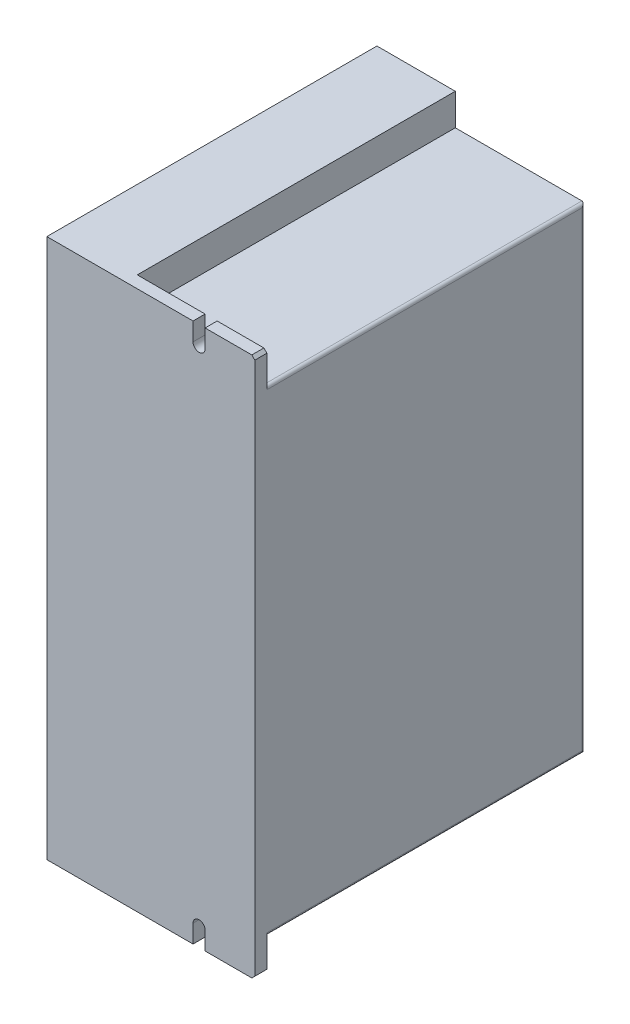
ISO-10303-21;
HEADER;
FILE_DESCRIPTION(('STEP AP214'),'2;1');
FILE_NAME('part.step','',(''),(''),'','','');
FILE_SCHEMA(('AUTOMOTIVE_DESIGN { 1 0 10303 214 1 1 1 1 }'));
ENDSEC;
DATA;
#1=APPLICATION_CONTEXT('core data for automotive mechanical design processes');
#2=APPLICATION_PROTOCOL_DEFINITION('international standard','automotive_design',2000,#1);
#3=PRODUCT_CONTEXT('',#1,'mechanical');
#4=PRODUCT('Part','Part','',(#3));
#5=PRODUCT_RELATED_PRODUCT_CATEGORY('part','',(#4));
#6=PRODUCT_DEFINITION_FORMATION('','',#4);
#7=PRODUCT_DEFINITION_CONTEXT('part definition',#1,'design');
#8=PRODUCT_DEFINITION('design','',#6,#7);
#9=PRODUCT_DEFINITION_SHAPE('','',#8);
#10=(LENGTH_UNIT() NAMED_UNIT(*) SI_UNIT(.MILLI.,.METRE.));
#11=(NAMED_UNIT(*) PLANE_ANGLE_UNIT() SI_UNIT($,.RADIAN.));
#12=(NAMED_UNIT(*) SI_UNIT($,.STERADIAN.) SOLID_ANGLE_UNIT());
#13=UNCERTAINTY_MEASURE_WITH_UNIT(LENGTH_MEASURE(1.E-05),#10,'distance_accuracy_value','');
#14=(GEOMETRIC_REPRESENTATION_CONTEXT(3) GLOBAL_UNCERTAINTY_ASSIGNED_CONTEXT((#13)) GLOBAL_UNIT_ASSIGNED_CONTEXT((#10,
#11,#12)) REPRESENTATION_CONTEXT('',''));
#15=CARTESIAN_POINT('',(0.,0.,0.));
#16=DIRECTION('',(0.,0.,1.));
#17=DIRECTION('',(1.,0.,0.));
#18=AXIS2_PLACEMENT_3D('',#15,#16,#17);
#19=CARTESIAN_POINT('',(69.,-89.5,54.75));
#20=DIRECTION('',(0.,1.,0.));
#21=DIRECTION('',(0.,0.,1.));
#22=AXIS2_PLACEMENT_3D('',#19,#20,#21);
#23=PLANE('',#22);
#24=DIRECTION('',(1.,0.,0.));
#25=VECTOR('',#24,1.);
#26=CARTESIAN_POINT('',(26.,-89.5,50.75));
#27=LINE('',#26,#25);
#28=CARTESIAN_POINT('',(52.5,-89.5,50.75));
#29=VERTEX_POINT('',#28);
#30=CARTESIAN_POINT('',(68.,-89.5,50.75));
#31=VERTEX_POINT('',#30);
#32=EDGE_CURVE('E264',#29,#31,#27,.T.);
#33=ORIENTED_EDGE('',*,*,#32,.T.);
#34=DIRECTION('',(0.,0.,1.));
#35=VECTOR('',#34,1.);
#36=CARTESIAN_POINT('',(68.,-89.5,54.75));
#37=LINE('',#36,#35);
#38=CARTESIAN_POINT('',(68.,-89.5,54.75));
#39=VERTEX_POINT('',#38);
#40=EDGE_CURVE('E349',#31,#39,#37,.T.);
#41=ORIENTED_EDGE('',*,*,#40,.T.);
#42=DIRECTION('',(-1.,0.,0.));
#43=VECTOR('',#42,1.);
#44=CARTESIAN_POINT('',(69.,-89.5,54.75));
#45=LINE('',#44,#43);
#46=CARTESIAN_POINT('',(52.5,-89.5,54.75));
#47=VERTEX_POINT('',#46);
#48=EDGE_CURVE('E310',#39,#47,#45,.T.);
#49=ORIENTED_EDGE('',*,*,#48,.T.);
#50=DIRECTION('',(0.,0.,1.));
#51=VECTOR('',#50,1.);
#52=CARTESIAN_POINT('',(52.5,-89.5,50.75));
#53=LINE('',#52,#51);
#54=EDGE_CURVE('E217',#29,#47,#53,.T.);
#55=ORIENTED_EDGE('',*,*,#54,.F.);
#56=EDGE_LOOP('',(#33,#41,#49,#55));
#57=FACE_BOUND('',#56,.T.);
#58=ADVANCED_FACE('F33',(#57),#23,.F.);
#59=CARTESIAN_POINT('',(69.,89.5,54.75));
#60=DIRECTION('',(0.,-1.,0.));
#61=DIRECTION('',(0.,0.,-1.));
#62=AXIS2_PLACEMENT_3D('',#59,#60,#61);
#63=PLANE('',#62);
#64=DIRECTION('',(-1.,0.,0.));
#65=VECTOR('',#64,1.);
#66=CARTESIAN_POINT('',(69.,89.5,54.75));
#67=LINE('',#66,#65);
#68=CARTESIAN_POINT('',(48.5,89.5,54.75));
#69=VERTEX_POINT('',#68);
#70=CARTESIAN_POINT('',(0.,89.5,54.75));
#71=VERTEX_POINT('',#70);
#72=EDGE_CURVE('E312',#69,#71,#67,.T.);
#73=ORIENTED_EDGE('',*,*,#72,.F.);
#74=DIRECTION('',(0.,0.,1.));
#75=VECTOR('',#74,1.);
#76=CARTESIAN_POINT('',(48.5,89.5,50.75));
#77=LINE('',#76,#75);
#78=CARTESIAN_POINT('',(48.5,89.5,50.75));
#79=VERTEX_POINT('',#78);
#80=EDGE_CURVE('E242',#79,#69,#77,.T.);
#81=ORIENTED_EDGE('',*,*,#80,.F.);
#82=DIRECTION('',(1.,0.,0.));
#83=VECTOR('',#82,1.);
#84=CARTESIAN_POINT('',(26.,89.5,50.75));
#85=LINE('',#84,#83);
#86=CARTESIAN_POINT('',(26.,89.5,50.75));
#87=VERTEX_POINT('',#86);
#88=EDGE_CURVE('E290',#87,#79,#85,.T.);
#89=ORIENTED_EDGE('',*,*,#88,.F.);
#90=DIRECTION('',(0.,0.,1.));
#91=VECTOR('',#90,1.);
#92=CARTESIAN_POINT('',(26.,89.5,-54.75));
#93=LINE('',#92,#91);
#94=CARTESIAN_POINT('',(26.,89.5,-54.75));
#95=VERTEX_POINT('',#94);
#96=EDGE_CURVE('E270',#95,#87,#93,.T.);
#97=ORIENTED_EDGE('',*,*,#96,.F.);
#98=DIRECTION('',(-1.,0.,0.));
#99=VECTOR('',#98,1.);
#100=CARTESIAN_POINT('',(69.,89.5,-54.75));
#101=LINE('',#100,#99);
#102=CARTESIAN_POINT('',(0.,89.5,-54.75));
#103=VERTEX_POINT('',#102);
#104=EDGE_CURVE('E315',#95,#103,#101,.T.);
#105=ORIENTED_EDGE('',*,*,#104,.T.);
#106=DIRECTION('',(0.,0.,1.));
#107=VECTOR('',#106,1.);
#108=CARTESIAN_POINT('',(0.,89.5,54.75));
#109=LINE('',#108,#107);
#110=EDGE_CURVE('E300',#103,#71,#109,.T.);
#111=ORIENTED_EDGE('',*,*,#110,.T.);
#112=EDGE_LOOP('',(#73,#81,#89,#97,#105,#111));
#113=FACE_BOUND('',#112,.T.);
#114=ADVANCED_FACE('F417',(#113),#63,.F.);
#115=CARTESIAN_POINT('',(69.,-89.5,-54.75));
#116=DIRECTION('',(0.,0.,1.));
#117=DIRECTION('',(1.,0.,0.));
#118=AXIS2_PLACEMENT_3D('',#115,#116,#117);
#119=PLANE('',#118);
#120=DIRECTION('',(1.,0.,0.));
#121=VECTOR('',#120,1.);
#122=CARTESIAN_POINT('',(26.,79.,-54.75));
#123=LINE('',#122,#121);
#124=CARTESIAN_POINT('',(26.,79.,-54.75));
#125=VERTEX_POINT('',#124);
#126=CARTESIAN_POINT('',(68.,79.,-54.75));
#127=VERTEX_POINT('',#126);
#128=EDGE_CURVE('E283',#125,#127,#123,.T.);
#129=ORIENTED_EDGE('',*,*,#128,.T.);
#130=DIRECTION('',(0.,1.,0.));
#131=VECTOR('',#130,1.);
#132=CARTESIAN_POINT('',(68.,-89.5,-54.75));
#133=LINE('',#132,#131);
#134=CARTESIAN_POINT('',(68.,-79.,-54.75));
#135=VERTEX_POINT('',#134);
#136=EDGE_CURVE('E327',#127,#135,#133,.F.);
#137=ORIENTED_EDGE('',*,*,#136,.T.);
#138=DIRECTION('',(1.,0.,0.));
#139=VECTOR('',#138,1.);
#140=CARTESIAN_POINT('',(26.,-79.,-54.75));
#141=LINE('',#140,#139);
#142=CARTESIAN_POINT('',(26.,-79.,-54.75));
#143=VERTEX_POINT('',#142);
#144=EDGE_CURVE('E259',#143,#135,#141,.T.);
#145=ORIENTED_EDGE('',*,*,#144,.F.);
#146=DIRECTION('',(0.,1.,0.));
#147=VECTOR('',#146,1.);
#148=CARTESIAN_POINT('',(26.,-79.,-54.75));
#149=LINE('',#148,#147);
#150=CARTESIAN_POINT('',(26.,-89.5,-54.75));
#151=VERTEX_POINT('',#150);
#152=EDGE_CURVE('E250',#151,#143,#149,.T.);
#153=ORIENTED_EDGE('',*,*,#152,.F.);
#154=DIRECTION('',(-1.,0.,0.));
#155=VECTOR('',#154,1.);
#156=CARTESIAN_POINT('',(69.,-89.5,-54.75));
#157=LINE('',#156,#155);
#158=CARTESIAN_POINT('',(0.,-89.5,-54.75));
#159=VERTEX_POINT('',#158);
#160=EDGE_CURVE('E296',#151,#159,#157,.T.);
#161=ORIENTED_EDGE('',*,*,#160,.T.);
#162=DIRECTION('',(0.,1.,0.));
#163=VECTOR('',#162,1.);
#164=CARTESIAN_POINT('',(0.,-89.5,-54.75));
#165=LINE('',#164,#163);
#166=EDGE_CURVE('E286',#159,#103,#165,.T.);
#167=ORIENTED_EDGE('',*,*,#166,.T.);
#168=ORIENTED_EDGE('',*,*,#104,.F.);
#169=DIRECTION('',(0.,1.,0.));
#170=VECTOR('',#169,1.);
#171=CARTESIAN_POINT('',(26.,79.,-54.75));
#172=LINE('',#171,#170);
#173=EDGE_CURVE('E279',#125,#95,#172,.T.);
#174=ORIENTED_EDGE('',*,*,#173,.F.);
#175=EDGE_LOOP('',(#129,#137,#145,#153,#161,#167,#168,#174));
#176=FACE_BOUND('',#175,.T.);
#177=ADVANCED_FACE('F426',(#176),#119,.F.);
#178=CARTESIAN_POINT('',(68.,89.5,54.75));
#179=VERTEX_POINT('',#178);
#180=CARTESIAN_POINT('',(52.5,89.5,54.75));
#181=VERTEX_POINT('',#180);
#182=EDGE_CURVE('E313',#179,#181,#67,.T.);
#183=ORIENTED_EDGE('',*,*,#182,.F.);
#184=DIRECTION('',(0.,0.,-1.));
#185=VECTOR('',#184,1.);
#186=CARTESIAN_POINT('',(68.,89.5,54.75));
#187=LINE('',#186,#185);
#188=CARTESIAN_POINT('',(68.,89.5,50.75));
#189=VERTEX_POINT('',#188);
#190=EDGE_CURVE('E41',#179,#189,#187,.T.);
#191=ORIENTED_EDGE('',*,*,#190,.T.);
#192=CARTESIAN_POINT('',(52.5,89.5,50.75));
#193=VERTEX_POINT('',#192);
#194=EDGE_CURVE('E281',#193,#189,#85,.T.);
#195=ORIENTED_EDGE('',*,*,#194,.F.);
#196=DIRECTION('',(0.,0.,1.));
#197=VECTOR('',#196,1.);
#198=CARTESIAN_POINT('',(52.5,89.5,50.75));
#199=LINE('',#198,#197);
#200=EDGE_CURVE('E244',#193,#181,#199,.T.);
#201=ORIENTED_EDGE('',*,*,#200,.T.);
#202=EDGE_LOOP('',(#183,#191,#195,#201));
#203=FACE_BOUND('',#202,.T.);
#204=ADVANCED_FACE('F402',(#203),#63,.F.);
#205=CARTESIAN_POINT('',(69.,-89.5,54.75));
#206=DIRECTION('',(0.,0.,-1.));
#207=DIRECTION('',(-1.,0.,0.));
#208=AXIS2_PLACEMENT_3D('',#205,#206,#207);
#209=PLANE('',#208);
#210=ORIENTED_EDGE('',*,*,#48,.F.);
#211=DIRECTION('',(-0.707106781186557,-0.707106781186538,0.));
#212=VECTOR('',#211,1.);
#213=CARTESIAN_POINT('',(69.,-88.5,54.75));
#214=LINE('',#213,#212);
#215=CARTESIAN_POINT('',(69.,-88.5,54.75));
#216=VERTEX_POINT('',#215);
#217=EDGE_CURVE('E352',#39,#216,#214,.F.);
#218=ORIENTED_EDGE('',*,*,#217,.T.);
#219=DIRECTION('',(0.,-1.,0.));
#220=VECTOR('',#219,1.);
#221=CARTESIAN_POINT('',(69.,-89.5,54.75));
#222=LINE('',#221,#220);
#223=CARTESIAN_POINT('',(69.,88.5,54.75));
#224=VERTEX_POINT('',#223);
#225=EDGE_CURVE('E293',#224,#216,#222,.T.);
#226=ORIENTED_EDGE('',*,*,#225,.F.);
#227=DIRECTION('',(0.707106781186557,-0.707106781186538,0.));
#228=VECTOR('',#227,1.);
#229=CARTESIAN_POINT('',(69.,88.5,54.75));
#230=LINE('',#229,#228);
#231=EDGE_CURVE('E55',#224,#179,#230,.F.);
#232=ORIENTED_EDGE('',*,*,#231,.T.);
#233=ORIENTED_EDGE('',*,*,#182,.T.);
#234=DIRECTION('',(0.,1.,0.));
#235=VECTOR('',#234,1.);
#236=CARTESIAN_POINT('',(52.5,89.5,54.75));
#237=LINE('',#236,#235);
#238=CARTESIAN_POINT('',(52.5,83.5,54.75));
#239=VERTEX_POINT('',#238);
#240=EDGE_CURVE('E234',#239,#181,#237,.T.);
#241=ORIENTED_EDGE('',*,*,#240,.F.);
#242=CARTESIAN_POINT('',(50.5,83.5,54.75));
#243=DIRECTION('',(0.,0.,1.));
#244=DIRECTION('',(1.,0.,0.));
#245=AXIS2_PLACEMENT_3D('',#242,#243,#244);
#246=CIRCLE('',#245,2.);
#247=CARTESIAN_POINT('',(48.5,83.5,54.75));
#248=VERTEX_POINT('',#247);
#249=EDGE_CURVE('E216',#248,#239,#246,.T.);
#250=ORIENTED_EDGE('',*,*,#249,.F.);
#251=DIRECTION('',(0.,-1.,0.));
#252=VECTOR('',#251,1.);
#253=CARTESIAN_POINT('',(48.5,83.5,54.75));
#254=LINE('',#253,#252);
#255=EDGE_CURVE('E225',#69,#248,#254,.T.);
#256=ORIENTED_EDGE('',*,*,#255,.F.);
#257=ORIENTED_EDGE('',*,*,#72,.T.);
#258=DIRECTION('',(0.,-1.,0.));
#259=VECTOR('',#258,1.);
#260=CARTESIAN_POINT('',(0.,-89.5,54.75));
#261=LINE('',#260,#259);
#262=CARTESIAN_POINT('',(0.,-89.5,54.75));
#263=VERTEX_POINT('',#262);
#264=EDGE_CURVE('E303',#71,#263,#261,.T.);
#265=ORIENTED_EDGE('',*,*,#264,.T.);
#266=CARTESIAN_POINT('',(48.5,-89.5,54.75));
#267=VERTEX_POINT('',#266);
#268=EDGE_CURVE('E309',#267,#263,#45,.T.);
#269=ORIENTED_EDGE('',*,*,#268,.F.);
#270=DIRECTION('',(0.,-1.,0.));
#271=VECTOR('',#270,1.);
#272=CARTESIAN_POINT('',(48.5,-83.5,54.75));
#273=LINE('',#272,#271);
#274=CARTESIAN_POINT('',(48.5,-83.5,54.75));
#275=VERTEX_POINT('',#274);
#276=EDGE_CURVE('E207',#275,#267,#273,.T.);
#277=ORIENTED_EDGE('',*,*,#276,.F.);
#278=CARTESIAN_POINT('',(50.5,-83.5,54.75));
#279=DIRECTION('',(0.,0.,1.));
#280=DIRECTION('',(1.,0.,0.));
#281=AXIS2_PLACEMENT_3D('',#278,#279,#280);
#282=CIRCLE('',#281,2.);
#283=CARTESIAN_POINT('',(52.5,-83.5,54.75));
#284=VERTEX_POINT('',#283);
#285=EDGE_CURVE('E188',#284,#275,#282,.T.);
#286=ORIENTED_EDGE('',*,*,#285,.F.);
#287=DIRECTION('',(0.,1.,0.));
#288=VECTOR('',#287,1.);
#289=CARTESIAN_POINT('',(52.5,-89.5,54.75));
#290=LINE('',#289,#288);
#291=EDGE_CURVE('E204',#47,#284,#290,.T.);
#292=ORIENTED_EDGE('',*,*,#291,.F.);
#293=EDGE_LOOP('',(#210,#218,#226,#232,#233,#241,#250,#256,#257,#265,#269,#277,#286,#292));
#294=FACE_BOUND('',#293,.T.);
#295=ADVANCED_FACE('F355',(#294),#209,.F.);
#296=CARTESIAN_POINT('',(26.,-89.5,50.75));
#297=VERTEX_POINT('',#296);
#298=CARTESIAN_POINT('',(48.5,-89.5,50.75));
#299=VERTEX_POINT('',#298);
#300=EDGE_CURVE('E261',#297,#299,#27,.T.);
#301=ORIENTED_EDGE('',*,*,#300,.T.);
#302=DIRECTION('',(0.,0.,1.));
#303=VECTOR('',#302,1.);
#304=CARTESIAN_POINT('',(48.5,-89.5,50.75));
#305=LINE('',#304,#303);
#306=EDGE_CURVE('E191',#299,#267,#305,.T.);
#307=ORIENTED_EDGE('',*,*,#306,.T.);
#308=ORIENTED_EDGE('',*,*,#268,.T.);
#309=DIRECTION('',(0.,0.,-1.));
#310=VECTOR('',#309,1.);
#311=CARTESIAN_POINT('',(0.,-89.5,54.75));
#312=LINE('',#311,#310);
#313=EDGE_CURVE('E297',#263,#159,#312,.T.);
#314=ORIENTED_EDGE('',*,*,#313,.T.);
#315=ORIENTED_EDGE('',*,*,#160,.F.);
#316=DIRECTION('',(0.,0.,-1.));
#317=VECTOR('',#316,1.);
#318=CARTESIAN_POINT('',(26.,-89.5,-54.75));
#319=LINE('',#318,#317);
#320=EDGE_CURVE('E248',#297,#151,#319,.T.);
#321=ORIENTED_EDGE('',*,*,#320,.F.);
#322=EDGE_LOOP('',(#301,#307,#308,#314,#315,#321));
#323=FACE_BOUND('',#322,.T.);
#324=ADVANCED_FACE('F372',(#323),#23,.F.);
#325=CARTESIAN_POINT('',(69.,0.,0.));
#326=DIRECTION('',(-1.,0.,0.));
#327=DIRECTION('',(0.,0.,1.));
#328=AXIS2_PLACEMENT_3D('',#325,#326,#327);
#329=PLANE('',#328);
#330=ORIENTED_EDGE('',*,*,#225,.T.);
#331=DIRECTION('',(0.,0.,-1.));
#332=VECTOR('',#331,1.);
#333=CARTESIAN_POINT('',(69.,-88.5,0.));
#334=LINE('',#333,#332);
#335=CARTESIAN_POINT('',(69.,-88.5,50.75));
#336=VERTEX_POINT('',#335);
#337=EDGE_CURVE('E344',#216,#336,#334,.T.);
#338=ORIENTED_EDGE('',*,*,#337,.T.);
#339=DIRECTION('',(0.,-1.,0.));
#340=VECTOR('',#339,1.);
#341=CARTESIAN_POINT('',(69.,-89.5,50.75));
#342=LINE('',#341,#340);
#343=CARTESIAN_POINT('',(69.,-78.,50.75));
#344=VERTEX_POINT('',#343);
#345=EDGE_CURVE('E241',#344,#336,#342,.T.);
#346=ORIENTED_EDGE('',*,*,#345,.F.);
#347=DIRECTION('',(0.,0.,1.));
#348=VECTOR('',#347,1.);
#349=CARTESIAN_POINT('',(69.,-78.,0.));
#350=LINE('',#349,#348);
#351=CARTESIAN_POINT('',(69.,-78.,-53.75));
#352=VERTEX_POINT('',#351);
#353=EDGE_CURVE('E325',#344,#352,#350,.F.);
#354=ORIENTED_EDGE('',*,*,#353,.T.);
#355=DIRECTION('',(0.,1.,0.));
#356=VECTOR('',#355,1.);
#357=CARTESIAN_POINT('',(69.,0.,-53.75));
#358=LINE('',#357,#356);
#359=CARTESIAN_POINT('',(69.,78.,-53.75));
#360=VERTEX_POINT('',#359);
#361=EDGE_CURVE('E323',#352,#360,#358,.T.);
#362=ORIENTED_EDGE('',*,*,#361,.T.);
#363=DIRECTION('',(0.,0.,-1.));
#364=VECTOR('',#363,1.);
#365=CARTESIAN_POINT('',(69.,78.,0.));
#366=LINE('',#365,#364);
#367=CARTESIAN_POINT('',(69.,78.,50.75));
#368=VERTEX_POINT('',#367);
#369=EDGE_CURVE('E320',#360,#368,#366,.F.);
#370=ORIENTED_EDGE('',*,*,#369,.T.);
#371=DIRECTION('',(0.,-1.,0.));
#372=VECTOR('',#371,1.);
#373=CARTESIAN_POINT('',(69.,89.5,50.75));
#374=LINE('',#373,#372);
#375=CARTESIAN_POINT('',(69.,88.5,50.75));
#376=VERTEX_POINT('',#375);
#377=EDGE_CURVE('E263',#376,#368,#374,.T.);
#378=ORIENTED_EDGE('',*,*,#377,.F.);
#379=DIRECTION('',(0.,0.,1.));
#380=VECTOR('',#379,1.);
#381=CARTESIAN_POINT('',(69.,88.5,0.));
#382=LINE('',#381,#380);
#383=EDGE_CURVE('E336',#376,#224,#382,.T.);
#384=ORIENTED_EDGE('',*,*,#383,.T.);
#385=EDGE_LOOP('',(#330,#338,#346,#354,#362,#370,#378,#384));
#386=FACE_BOUND('',#385,.T.);
#387=ADVANCED_FACE('F361',(#386),#329,.F.);
#388=CARTESIAN_POINT('',(0.,0.,0.));
#389=DIRECTION('',(-1.,0.,0.));
#390=DIRECTION('',(0.,0.,1.));
#391=AXIS2_PLACEMENT_3D('',#388,#389,#390);
#392=PLANE('',#391);
#393=ORIENTED_EDGE('',*,*,#166,.F.);
#394=ORIENTED_EDGE('',*,*,#313,.F.);
#395=ORIENTED_EDGE('',*,*,#264,.F.);
#396=ORIENTED_EDGE('',*,*,#110,.F.);
#397=EDGE_LOOP('',(#393,#394,#395,#396));
#398=FACE_BOUND('',#397,.T.);
#399=ADVANCED_FACE('F430',(#398),#392,.T.);
#400=CARTESIAN_POINT('',(26.,79.,50.75));
#401=DIRECTION('',(0.,-1.,0.));
#402=DIRECTION('',(0.,0.,-1.));
#403=AXIS2_PLACEMENT_3D('',#400,#401,#402);
#404=PLANE('',#403);
#405=DIRECTION('',(1.,0.,0.));
#406=VECTOR('',#405,1.);
#407=CARTESIAN_POINT('',(26.,79.,50.75));
#408=LINE('',#407,#406);
#409=CARTESIAN_POINT('',(26.,79.,50.75));
#410=VERTEX_POINT('',#409);
#411=CARTESIAN_POINT('',(68.,79.,50.75));
#412=VERTEX_POINT('',#411);
#413=EDGE_CURVE('E287',#410,#412,#408,.T.);
#414=ORIENTED_EDGE('',*,*,#413,.T.);
#415=DIRECTION('',(0.,0.,-1.));
#416=VECTOR('',#415,1.);
#417=CARTESIAN_POINT('',(68.,79.,50.75));
#418=LINE('',#417,#416);
#419=EDGE_CURVE('E329',#412,#127,#418,.T.);
#420=ORIENTED_EDGE('',*,*,#419,.T.);
#421=ORIENTED_EDGE('',*,*,#128,.F.);
#422=DIRECTION('',(0.,0.,-1.));
#423=VECTOR('',#422,1.);
#424=CARTESIAN_POINT('',(26.,79.,50.75));
#425=LINE('',#424,#423);
#426=EDGE_CURVE('E276',#410,#125,#425,.T.);
#427=ORIENTED_EDGE('',*,*,#426,.F.);
#428=EDGE_LOOP('',(#414,#420,#421,#427));
#429=FACE_BOUND('',#428,.T.);
#430=ADVANCED_FACE('F433',(#429),#404,.F.);
#431=CARTESIAN_POINT('',(26.,89.5,50.75));
#432=DIRECTION('',(0.,0.,1.));
#433=DIRECTION('',(1.,0.,0.));
#434=AXIS2_PLACEMENT_3D('',#431,#432,#433);
#435=PLANE('',#434);
#436=ORIENTED_EDGE('',*,*,#194,.T.);
#437=DIRECTION('',(-0.707106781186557,0.707106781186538,0.));
#438=VECTOR('',#437,1.);
#439=CARTESIAN_POINT('',(69.,88.5,50.75));
#440=LINE('',#439,#438);
#441=EDGE_CURVE('E11',#189,#376,#440,.F.);
#442=ORIENTED_EDGE('',*,*,#441,.T.);
#443=ORIENTED_EDGE('',*,*,#377,.T.);
#444=CARTESIAN_POINT('',(68.,78.,50.75));
#445=DIRECTION('',(0.,0.,1.));
#446=DIRECTION('',(1.,0.,0.));
#447=AXIS2_PLACEMENT_3D('',#444,#445,#446);
#448=CIRCLE('',#447,1.);
#449=EDGE_CURVE('E334',#368,#412,#448,.T.);
#450=ORIENTED_EDGE('',*,*,#449,.T.);
#451=ORIENTED_EDGE('',*,*,#413,.F.);
#452=DIRECTION('',(0.,-1.,0.));
#453=VECTOR('',#452,1.);
#454=CARTESIAN_POINT('',(26.,89.5,50.75));
#455=LINE('',#454,#453);
#456=EDGE_CURVE('E273',#87,#410,#455,.T.);
#457=ORIENTED_EDGE('',*,*,#456,.F.);
#458=ORIENTED_EDGE('',*,*,#88,.T.);
#459=DIRECTION('',(0.,-1.,0.));
#460=VECTOR('',#459,1.);
#461=CARTESIAN_POINT('',(48.5,83.5,50.75));
#462=LINE('',#461,#460);
#463=CARTESIAN_POINT('',(48.5,83.5,50.75));
#464=VERTEX_POINT('',#463);
#465=EDGE_CURVE('E228',#79,#464,#462,.T.);
#466=ORIENTED_EDGE('',*,*,#465,.T.);
#467=CARTESIAN_POINT('',(50.5,83.5,50.75));
#468=DIRECTION('',(0.,0.,1.));
#469=DIRECTION('',(1.,0.,0.));
#470=AXIS2_PLACEMENT_3D('',#467,#468,#469);
#471=CIRCLE('',#470,2.);
#472=CARTESIAN_POINT('',(52.5,83.5,50.75));
#473=VERTEX_POINT('',#472);
#474=EDGE_CURVE('E221',#464,#473,#471,.T.);
#475=ORIENTED_EDGE('',*,*,#474,.T.);
#476=DIRECTION('',(0.,1.,0.));
#477=VECTOR('',#476,1.);
#478=CARTESIAN_POINT('',(52.5,89.5,50.75));
#479=LINE('',#478,#477);
#480=EDGE_CURVE('E224',#473,#193,#479,.T.);
#481=ORIENTED_EDGE('',*,*,#480,.T.);
#482=EDGE_LOOP('',(#436,#442,#443,#450,#451,#457,#458,#466,#475,#481));
#483=FACE_BOUND('',#482,.T.);
#484=ADVANCED_FACE('F400',(#483),#435,.F.);
#485=CARTESIAN_POINT('',(26.,0.,0.));
#486=DIRECTION('',(1.,0.,0.));
#487=DIRECTION('',(0.,0.,-1.));
#488=AXIS2_PLACEMENT_3D('',#485,#486,#487);
#489=PLANE('',#488);
#490=ORIENTED_EDGE('',*,*,#96,.T.);
#491=ORIENTED_EDGE('',*,*,#456,.T.);
#492=ORIENTED_EDGE('',*,*,#426,.T.);
#493=ORIENTED_EDGE('',*,*,#173,.T.);
#494=EDGE_LOOP('',(#490,#491,#492,#493));
#495=FACE_BOUND('',#494,.T.);
#496=ADVANCED_FACE('F421',(#495),#489,.T.);
#497=CARTESIAN_POINT('',(26.,-89.5,50.75));
#498=DIRECTION('',(0.,0.,1.));
#499=DIRECTION('',(1.,0.,0.));
#500=AXIS2_PLACEMENT_3D('',#497,#498,#499);
#501=PLANE('',#500);
#502=ORIENTED_EDGE('',*,*,#345,.T.);
#503=DIRECTION('',(0.707106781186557,0.707106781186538,0.));
#504=VECTOR('',#503,1.);
#505=CARTESIAN_POINT('',(69.,-88.5,50.75));
#506=LINE('',#505,#504);
#507=EDGE_CURVE('E347',#336,#31,#506,.F.);
#508=ORIENTED_EDGE('',*,*,#507,.T.);
#509=ORIENTED_EDGE('',*,*,#32,.F.);
#510=DIRECTION('',(0.,1.,0.));
#511=VECTOR('',#510,1.);
#512=CARTESIAN_POINT('',(52.5,-89.5,50.75));
#513=LINE('',#512,#511);
#514=CARTESIAN_POINT('',(52.5,-83.5,50.75));
#515=VERTEX_POINT('',#514);
#516=EDGE_CURVE('E192',#29,#515,#513,.T.);
#517=ORIENTED_EDGE('',*,*,#516,.T.);
#518=CARTESIAN_POINT('',(50.5,-83.5,50.75));
#519=DIRECTION('',(0.,0.,1.));
#520=DIRECTION('',(1.,0.,0.));
#521=AXIS2_PLACEMENT_3D('',#518,#519,#520);
#522=CIRCLE('',#521,2.);
#523=CARTESIAN_POINT('',(48.5,-83.5,50.75));
#524=VERTEX_POINT('',#523);
#525=EDGE_CURVE('E185',#515,#524,#522,.T.);
#526=ORIENTED_EDGE('',*,*,#525,.T.);
#527=DIRECTION('',(0.,-1.,0.));
#528=VECTOR('',#527,1.);
#529=CARTESIAN_POINT('',(48.5,-83.5,50.75));
#530=LINE('',#529,#528);
#531=EDGE_CURVE('E195',#524,#299,#530,.T.);
#532=ORIENTED_EDGE('',*,*,#531,.T.);
#533=ORIENTED_EDGE('',*,*,#300,.F.);
#534=DIRECTION('',(0.,-1.,0.));
#535=VECTOR('',#534,1.);
#536=CARTESIAN_POINT('',(26.,-89.5,50.75));
#537=LINE('',#536,#535);
#538=CARTESIAN_POINT('',(26.,-79.,50.75));
#539=VERTEX_POINT('',#538);
#540=EDGE_CURVE('E256',#539,#297,#537,.T.);
#541=ORIENTED_EDGE('',*,*,#540,.F.);
#542=DIRECTION('',(1.,0.,0.));
#543=VECTOR('',#542,1.);
#544=CARTESIAN_POINT('',(26.,-79.,50.75));
#545=LINE('',#544,#543);
#546=CARTESIAN_POINT('',(68.,-79.,50.75));
#547=VERTEX_POINT('',#546);
#548=EDGE_CURVE('E265',#539,#547,#545,.T.);
#549=ORIENTED_EDGE('',*,*,#548,.T.);
#550=CARTESIAN_POINT('',(68.,-78.,50.75));
#551=DIRECTION('',(0.,0.,1.));
#552=DIRECTION('',(1.,0.,0.));
#553=AXIS2_PLACEMENT_3D('',#550,#551,#552);
#554=CIRCLE('',#553,1.);
#555=EDGE_CURVE('E331',#547,#344,#554,.T.);
#556=ORIENTED_EDGE('',*,*,#555,.T.);
#557=EDGE_LOOP('',(#502,#508,#509,#517,#526,#532,#533,#541,#549,#556));
#558=FACE_BOUND('',#557,.T.);
#559=ADVANCED_FACE('F202',(#558),#501,.F.);
#560=CARTESIAN_POINT('',(26.,-79.,50.75));
#561=DIRECTION('',(0.,1.,0.));
#562=DIRECTION('',(0.,0.,1.));
#563=AXIS2_PLACEMENT_3D('',#560,#561,#562);
#564=PLANE('',#563);
#565=ORIENTED_EDGE('',*,*,#144,.T.);
#566=DIRECTION('',(0.,0.,1.));
#567=VECTOR('',#566,1.);
#568=CARTESIAN_POINT('',(68.,-79.,50.75));
#569=LINE('',#568,#567);
#570=EDGE_CURVE('E317',#135,#547,#569,.T.);
#571=ORIENTED_EDGE('',*,*,#570,.T.);
#572=ORIENTED_EDGE('',*,*,#548,.F.);
#573=DIRECTION('',(0.,0.,1.));
#574=VECTOR('',#573,1.);
#575=CARTESIAN_POINT('',(26.,-79.,50.75));
#576=LINE('',#575,#574);
#577=EDGE_CURVE('E253',#143,#539,#576,.T.);
#578=ORIENTED_EDGE('',*,*,#577,.F.);
#579=EDGE_LOOP('',(#565,#571,#572,#578));
#580=FACE_BOUND('',#579,.T.);
#581=ADVANCED_FACE('F381',(#580),#564,.F.);
#582=CARTESIAN_POINT('',(26.,0.,0.));
#583=DIRECTION('',(-1.,0.,0.));
#584=DIRECTION('',(0.,0.,1.));
#585=AXIS2_PLACEMENT_3D('',#582,#583,#584);
#586=PLANE('',#585);
#587=ORIENTED_EDGE('',*,*,#320,.T.);
#588=ORIENTED_EDGE('',*,*,#152,.T.);
#589=ORIENTED_EDGE('',*,*,#577,.T.);
#590=ORIENTED_EDGE('',*,*,#540,.T.);
#591=EDGE_LOOP('',(#587,#588,#589,#590));
#592=FACE_BOUND('',#591,.T.);
#593=ADVANCED_FACE('F377',(#592),#586,.F.);
#594=CARTESIAN_POINT('',(50.5,83.5,50.75));
#595=DIRECTION('',(0.,0.,1.));
#596=DIRECTION('',(1.,0.,0.));
#597=AXIS2_PLACEMENT_3D('',#594,#595,#596);
#598=CYLINDRICAL_SURFACE('',#597,2.);
#599=ORIENTED_EDGE('',*,*,#249,.T.);
#600=DIRECTION('',(0.,0.,1.));
#601=VECTOR('',#600,1.);
#602=CARTESIAN_POINT('',(52.5,83.5,50.75));
#603=LINE('',#602,#601);
#604=EDGE_CURVE('E231',#473,#239,#603,.T.);
#605=ORIENTED_EDGE('',*,*,#604,.F.);
#606=ORIENTED_EDGE('',*,*,#474,.F.);
#607=DIRECTION('',(0.,0.,1.));
#608=VECTOR('',#607,1.);
#609=CARTESIAN_POINT('',(48.5,83.5,50.75));
#610=LINE('',#609,#608);
#611=EDGE_CURVE('E239',#464,#248,#610,.T.);
#612=ORIENTED_EDGE('',*,*,#611,.T.);
#613=EDGE_LOOP('',(#599,#605,#606,#612));
#614=FACE_BOUND('',#613,.T.);
#615=ADVANCED_FACE('F410',(#614),#598,.F.);
#616=CARTESIAN_POINT('',(48.5,83.5,50.75));
#617=DIRECTION('',(-1.,0.,0.));
#618=DIRECTION('',(0.,0.,1.));
#619=AXIS2_PLACEMENT_3D('',#616,#617,#618);
#620=PLANE('',#619);
#621=ORIENTED_EDGE('',*,*,#255,.T.);
#622=ORIENTED_EDGE('',*,*,#611,.F.);
#623=ORIENTED_EDGE('',*,*,#465,.F.);
#624=ORIENTED_EDGE('',*,*,#80,.T.);
#625=EDGE_LOOP('',(#621,#622,#623,#624));
#626=FACE_BOUND('',#625,.T.);
#627=ADVANCED_FACE('F413',(#626),#620,.F.);
#628=CARTESIAN_POINT('',(52.5,89.5,50.75));
#629=DIRECTION('',(1.,0.,0.));
#630=DIRECTION('',(0.,0.,-1.));
#631=AXIS2_PLACEMENT_3D('',#628,#629,#630);
#632=PLANE('',#631);
#633=ORIENTED_EDGE('',*,*,#240,.T.);
#634=ORIENTED_EDGE('',*,*,#200,.F.);
#635=ORIENTED_EDGE('',*,*,#480,.F.);
#636=ORIENTED_EDGE('',*,*,#604,.T.);
#637=EDGE_LOOP('',(#633,#634,#635,#636));
#638=FACE_BOUND('',#637,.T.);
#639=ADVANCED_FACE('F404',(#638),#632,.F.);
#640=CARTESIAN_POINT('',(50.5,-83.5,50.75));
#641=DIRECTION('',(0.,0.,1.));
#642=DIRECTION('',(1.,0.,0.));
#643=AXIS2_PLACEMENT_3D('',#640,#641,#642);
#644=CYLINDRICAL_SURFACE('',#643,2.);
#645=ORIENTED_EDGE('',*,*,#285,.T.);
#646=DIRECTION('',(0.,0.,1.));
#647=VECTOR('',#646,1.);
#648=CARTESIAN_POINT('',(48.5,-83.5,50.75));
#649=LINE('',#648,#647);
#650=EDGE_CURVE('E181',#524,#275,#649,.T.);
#651=ORIENTED_EDGE('',*,*,#650,.F.);
#652=ORIENTED_EDGE('',*,*,#525,.F.);
#653=DIRECTION('',(0.,0.,1.));
#654=VECTOR('',#653,1.);
#655=CARTESIAN_POINT('',(52.5,-83.5,50.75));
#656=LINE('',#655,#654);
#657=EDGE_CURVE('E214',#515,#284,#656,.T.);
#658=ORIENTED_EDGE('',*,*,#657,.T.);
#659=EDGE_LOOP('',(#645,#651,#652,#658));
#660=FACE_BOUND('',#659,.T.);
#661=ADVANCED_FACE('F183',(#660),#644,.F.);
#662=CARTESIAN_POINT('',(52.5,-89.5,50.75));
#663=DIRECTION('',(1.,0.,0.));
#664=DIRECTION('',(0.,0.,-1.));
#665=AXIS2_PLACEMENT_3D('',#662,#663,#664);
#666=PLANE('',#665);
#667=ORIENTED_EDGE('',*,*,#291,.T.);
#668=ORIENTED_EDGE('',*,*,#657,.F.);
#669=ORIENTED_EDGE('',*,*,#516,.F.);
#670=ORIENTED_EDGE('',*,*,#54,.T.);
#671=EDGE_LOOP('',(#667,#668,#669,#670));
#672=FACE_BOUND('',#671,.T.);
#673=ADVANCED_FACE('F369',(#672),#666,.F.);
#674=CARTESIAN_POINT('',(48.5,-83.5,50.75));
#675=DIRECTION('',(-1.,0.,0.));
#676=DIRECTION('',(0.,-1.,0.));
#677=AXIS2_PLACEMENT_3D('',#674,#675,#676);
#678=PLANE('',#677);
#679=ORIENTED_EDGE('',*,*,#276,.T.);
#680=ORIENTED_EDGE('',*,*,#306,.F.);
#681=ORIENTED_EDGE('',*,*,#531,.F.);
#682=ORIENTED_EDGE('',*,*,#650,.T.);
#683=EDGE_LOOP('',(#679,#680,#681,#682));
#684=FACE_BOUND('',#683,.T.);
#685=ADVANCED_FACE('F196',(#684),#678,.F.);
#686=CARTESIAN_POINT('',(68.,78.,50.75));
#687=DIRECTION('',(0.,0.,-1.));
#688=DIRECTION('',(0.,1.,0.));
#689=AXIS2_PLACEMENT_3D('',#686,#687,#688);
#690=CYLINDRICAL_SURFACE('',#689,1.);
#691=ORIENTED_EDGE('',*,*,#449,.F.);
#692=ORIENTED_EDGE('',*,*,#369,.F.);
#693=CARTESIAN_POINT('',(68.,78.,-53.75));
#694=DIRECTION('',(0.,-0.707106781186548,-0.707106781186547));
#695=DIRECTION('',(0.,0.707106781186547,-0.707106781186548));
#696=AXIS2_PLACEMENT_3D('',#693,#694,#695);
#697=ELLIPSE('',#696,1.41421356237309,1.);
#698=EDGE_CURVE('E212',#127,#360,#697,.T.);
#699=ORIENTED_EDGE('',*,*,#698,.F.);
#700=ORIENTED_EDGE('',*,*,#419,.F.);
#701=EDGE_LOOP('',(#691,#692,#699,#700));
#702=FACE_BOUND('',#701,.T.);
#703=ADVANCED_FACE('F396',(#702),#690,.T.);
#704=CARTESIAN_POINT('',(68.,0.,-53.75));
#705=DIRECTION('',(0.,1.,0.));
#706=DIRECTION('',(0.,0.,1.));
#707=AXIS2_PLACEMENT_3D('',#704,#705,#706);
#708=CYLINDRICAL_SURFACE('',#707,1.);
#709=ORIENTED_EDGE('',*,*,#698,.T.);
#710=ORIENTED_EDGE('',*,*,#361,.F.);
#711=CARTESIAN_POINT('',(68.,-78.,-53.75));
#712=DIRECTION('',(0.,0.707106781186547,-0.707106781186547));
#713=DIRECTION('',(0.,0.707106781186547,0.707106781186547));
#714=AXIS2_PLACEMENT_3D('',#711,#712,#713);
#715=ELLIPSE('',#714,1.41421356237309,1.);
#716=EDGE_CURVE('E337',#135,#352,#715,.F.);
#717=ORIENTED_EDGE('',*,*,#716,.F.);
#718=ORIENTED_EDGE('',*,*,#136,.F.);
#719=EDGE_LOOP('',(#709,#710,#717,#718));
#720=FACE_BOUND('',#719,.T.);
#721=ADVANCED_FACE('F390',(#720),#708,.T.);
#722=CARTESIAN_POINT('',(68.,-78.,50.75));
#723=DIRECTION('',(0.,0.,1.));
#724=DIRECTION('',(1.,0.,0.));
#725=AXIS2_PLACEMENT_3D('',#722,#723,#724);
#726=CYLINDRICAL_SURFACE('',#725,1.);
#727=ORIENTED_EDGE('',*,*,#716,.T.);
#728=ORIENTED_EDGE('',*,*,#353,.F.);
#729=ORIENTED_EDGE('',*,*,#555,.F.);
#730=ORIENTED_EDGE('',*,*,#570,.F.);
#731=EDGE_LOOP('',(#727,#728,#729,#730));
#732=FACE_BOUND('',#731,.T.);
#733=ADVANCED_FACE('F386',(#732),#726,.T.);
#734=CARTESIAN_POINT('',(69.,-88.5,0.));
#735=DIRECTION('',(-0.707106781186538,0.707106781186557,0.));
#736=DIRECTION('',(0.,0.,-1.));
#737=AXIS2_PLACEMENT_3D('',#734,#735,#736);
#738=PLANE('',#737);
#739=ORIENTED_EDGE('',*,*,#217,.F.);
#740=ORIENTED_EDGE('',*,*,#40,.F.);
#741=ORIENTED_EDGE('',*,*,#507,.F.);
#742=ORIENTED_EDGE('',*,*,#337,.F.);
#743=EDGE_LOOP('',(#739,#740,#741,#742));
#744=FACE_BOUND('',#743,.T.);
#745=ADVANCED_FACE('F364',(#744),#738,.F.);
#746=CARTESIAN_POINT('',(69.,88.5,0.));
#747=DIRECTION('',(-0.707106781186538,-0.707106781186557,0.));
#748=DIRECTION('',(0.,0.,1.));
#749=AXIS2_PLACEMENT_3D('',#746,#747,#748);
#750=PLANE('',#749);
#751=ORIENTED_EDGE('',*,*,#441,.F.);
#752=ORIENTED_EDGE('',*,*,#190,.F.);
#753=ORIENTED_EDGE('',*,*,#231,.F.);
#754=ORIENTED_EDGE('',*,*,#383,.F.);
#755=EDGE_LOOP('',(#751,#752,#753,#754));
#756=FACE_BOUND('',#755,.T.);
#757=ADVANCED_FACE('F35',(#756),#750,.F.);
#758=CLOSED_SHELL('',(#58,#114,#177,#204,#295,#324,#387,#399,#430,#484,#496,#559,#581,#593,#615,
#627,#639,#661,#673,#685,#703,#721,#733,#745,#757));
#759=MANIFOLD_SOLID_BREP('B2',#758);
#760=ADVANCED_BREP_SHAPE_REPRESENTATION('',(#18,#759),#14);
#761=SHAPE_DEFINITION_REPRESENTATION(#9,#760);
ENDSEC;
END-ISO-10303-21;
